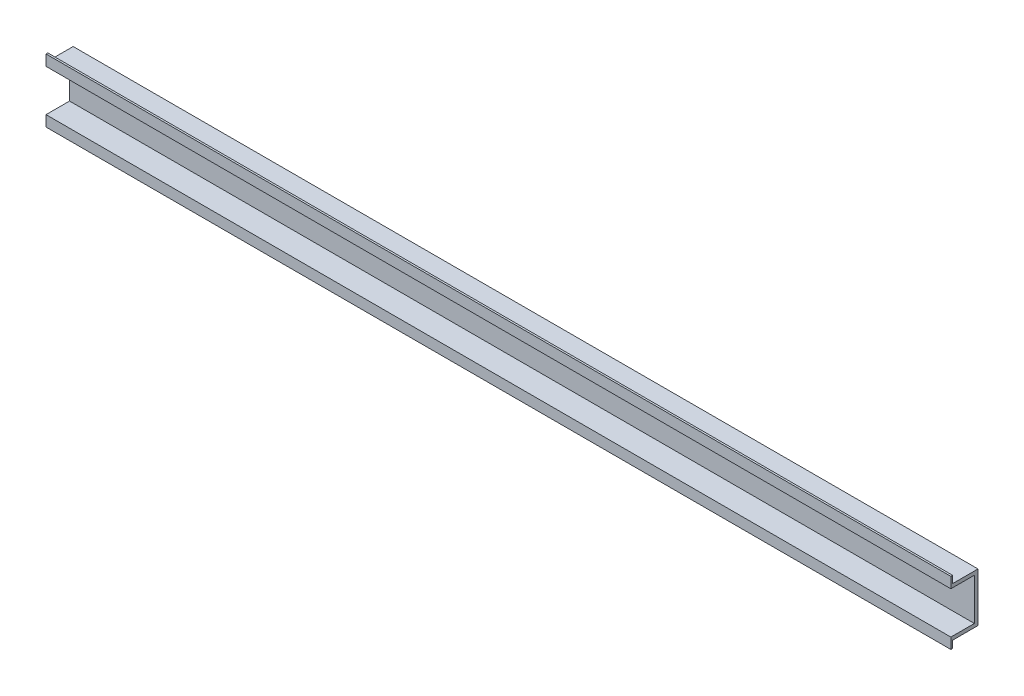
from build123d import *

# Parameters (mm, degrees)
EW_EXTRUDE_DEPTH = 500


with BuildPart() as part:
    # EW_SKETCH → EW_EXTRUDE (new body)
    with BuildSketch(Plane(origin=(0, 0, 0), x_dir=(0, 0, -1), z_dir=(1, 0, 0))):
        Polygon((-15, -17.5), (-14, -17.5), (-14, -13.55), (0, -13.55), (0, 13.55), (-14, 13.55), (-14, 17.5), (-15, 17.5), (-15, 11.55), (-2, 11.55), (-2, -11.55), (-15, -11.55), align=None)
    extrude(amount=EW_EXTRUDE_DEPTH)


solid = part.part
